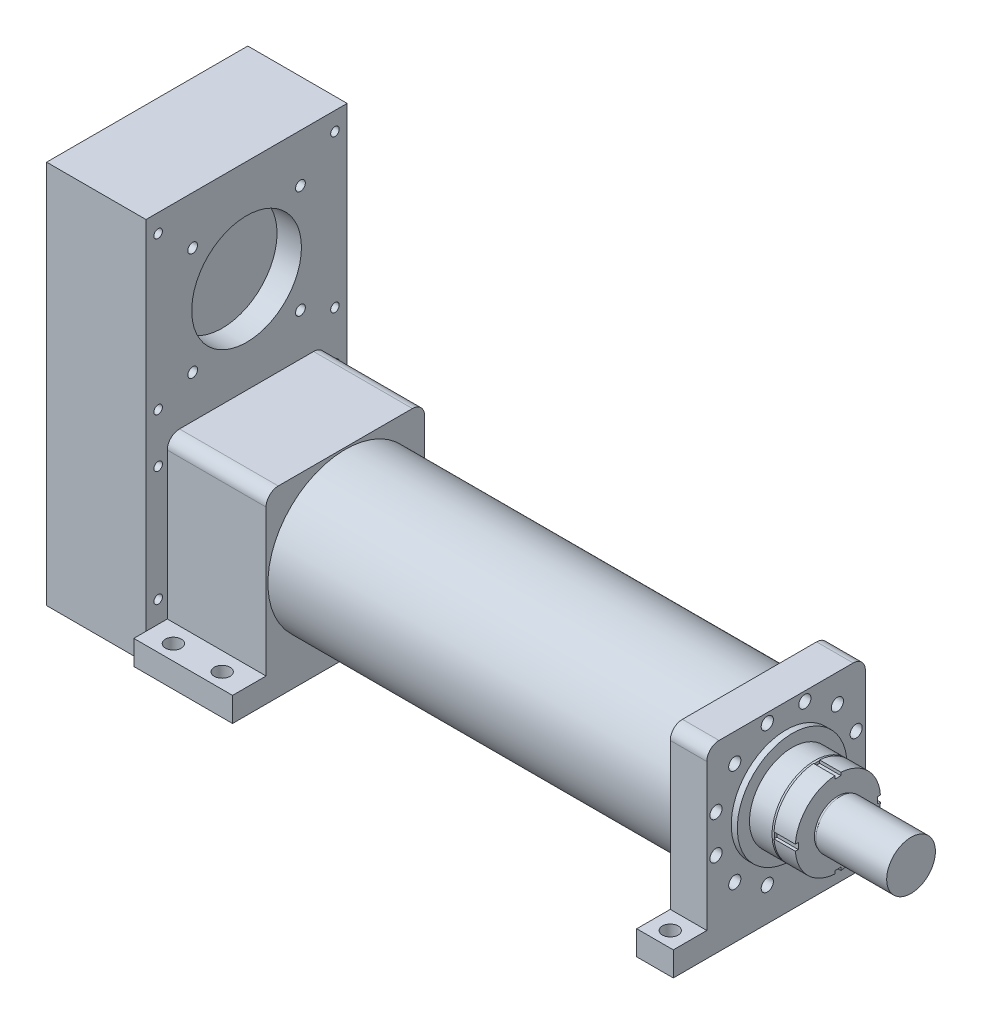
from build123d import *

# Parameters (mm, degrees)
SKETCH_1_R          = 127
SKETCH_1_R_2        = 110
EXTRUDE_1_DEPTH     = 663
EXTRUDE_2_DEPTH     = 60
SKETCH_3_R          = 90
EXTRUDE_3_DEPTH     = 10
SKETCH_5_R          = 70
EXTRUDE_4_DEPTH     = 40
CHAMFER_1_SIZE      = 3
CHAMFER_1_SIZE2     = 1.091910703
SKETCH_7_R          = 70
EXTRUDE_5_DEPTH     = 35
SKETCH_8_R          = 38.5
EXTRUDE_6_DEPTH     = 4
SKETCH_9_R          = 40
EXTRUDE_7_DEPTH     = 116
SKETCH_10_W         = 10
SKETCH_10_H         = 12.219318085
SKETCH_10_W_2       = 33.965202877
SKETCH_10_H_2       = 10
SKETCH_10_H_3       = 35.687535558
CUT_EXTRUDE_2_DEPTH = 35
EXTRUDE_8_DEPTH     = 162
SKETCH_12_W         = 330
SKETCH_12_H         = 630
EXTRUDE_9_DEPTH     = 163
SKETCH_14_R         = 90
SKETCH_14_R_2       = 8
SKETCH_14_R_3       = 7
CUT_EXTRUDE_3_DEPTH = 40
SKETCH_15_R         = 10
SKETCH_15_R_2       = 6.5
CUT_EXTRUDE_4_DEPTH = 20
SKETCH_15_3_R       = 6.5
CUT_EXTRUDE_5_DEPTH = 50
SKETCH_16_W         = 162
SKETCH_16_H         = 370
SKETCH_16_R         = 13
SKETCH_16_W_2       = 60
EXTRUDE_10_DEPTH    = 40


with BuildPart() as part:
    # Sketch 1 → Extrude 1 (new body)
    with BuildSketch(Plane(origin=(0, 0, 0), x_dir=(0, 0, -1), z_dir=(1, 0, 0))):
        Circle(SKETCH_1_R)
        Circle(SKETCH_1_R_2, mode=Mode.SUBTRACT)
    extrude(amount=EXTRUDE_1_DEPTH)


with BuildPart() as body_2:
    # Sketch 2 → Extrude 2 (new body)
    with BuildSketch(Plane(origin=(663, 0, 0), x_dir=(0, 0, -1), z_dir=(1, 0, 0))):
        with BuildLine():
            Line((-130, -110), (-130, -130))
            Line((-130, -130), (-110, -130))
            Line((-110, -130), (110, -130))
            Line((110, -130), (130, -130))
            Line((130, -130), (130, -110))
            Line((130, -110), (130, 110))
            ThreePointArc((130, 110), (124.142135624, 124.142135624), (110, 130))
            Line((110, 130), (-110, 130))
            ThreePointArc((-110, 130), (-124.142135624, 124.142135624), (-130, 110))
            Line((-130, 110), (-130, -110))
        make_face()
    extrude(amount=EXTRUDE_2_DEPTH)

    # Sketch 3 → Extrude 3 (add)
    with BuildSketch(Plane(origin=(723, 0, 0), x_dir=(0, 0, -1), z_dir=(1, 0, 0))):
        Circle(SKETCH_3_R)
    extrude(amount=EXTRUDE_3_DEPTH)

    # Sketch 5 → Extrude 4 (add)
    with BuildSketch(Plane(origin=(733, 0, 0), x_dir=(0, 0, -1), z_dir=(1, 0, 0))):
        Circle(SKETCH_5_R)
    extrude(amount=EXTRUDE_4_DEPTH)

    # Chamfer 1
    chamfer_1_edges = [body_2.edges().sort_by_distance(p)[0] for p in [
        (773, 0, 70),
    ]]
    chamfer_1_side = [body_2.faces().sort_by_distance(p)[0] for p in [
        (753, 0, 70),
    ]]
    chamfer(chamfer_1_edges, length=CHAMFER_1_SIZE, length2=CHAMFER_1_SIZE2, reference=chamfer_1_side[0])

    # Sketch 7 → Extrude 5 (add)
    with BuildSketch(Plane(origin=(773, 0, 0), x_dir=(0, 0, -1), z_dir=(1, 0, 0))):
        Circle(SKETCH_7_R)
    extrude(amount=EXTRUDE_5_DEPTH)

    # Sketch 8 → Extrude 6 (add)
    with BuildSketch(Plane(origin=(808, 0, 0), x_dir=(0, 0, -1), z_dir=(1, 0, 0))):
        Circle(SKETCH_8_R)
    extrude(amount=EXTRUDE_6_DEPTH)

    # Sketch 9 → Extrude 7 (add)
    with BuildSketch(Plane(origin=(812, 0, 0), x_dir=(0, 0, -1), z_dir=(1, 0, 0))):
        with Locations(Location((0, 0, 0), (0, 0, 180))):
            Circle(SKETCH_9_R)
    extrude(amount=EXTRUDE_7_DEPTH)

    # Sketch 10 → Cut-Extrude 2 (cut)
    with BuildSketch(Plane(origin=(808, 0, 0), x_dir=(0, 0, -1), z_dir=(1, 0, 0))):
        with Locations((0, -71.109659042)):
            Rectangle(SKETCH_10_W, SKETCH_10_H)
        Polygon((-76.465931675, 5), (-65, 5), (-65, -5), (-79.460488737, -5), align=None)
        with Locations((81.982601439, 0)):
            Rectangle(SKETCH_10_W_2, SKETCH_10_H_2)
        with Locations((0, 82.843767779)):
            Rectangle(SKETCH_10_W, SKETCH_10_H_3)
    extrude(amount=-CUT_EXTRUDE_2_DEPTH, mode=Mode.SUBTRACT)

    # Sketch 15 → Cut-Extrude 4 (cut)
    # profile 1 of 12: a face of its own
    with BuildSketch(Plane(origin=(723, 0, 0), x_dir=(0, 0, -1), z_dir=(1, 0, 0))):
        with Locations((-84.145706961, 84.145706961)):
            Circle(SKETCH_15_R)
        with Locations((-84.145706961, 84.145706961)):
            Circle(SKETCH_15_R_2, mode=Mode.SUBTRACT)
    # profile 2 of 12: a face of its own
    with BuildSketch(Plane(origin=(723, 0, 0), x_dir=(0, 0, -1), z_dir=(1, 0, 0))):
        with Locations((30.799466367, 114.945173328)):
            Circle(SKETCH_15_R)
    # profile 3 of 12: a face of its own
    with BuildSketch(Plane(origin=(723, 0, 0), x_dir=(0, 0, -1), z_dir=(1, 0, 0))):
        with Locations((84.145706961, 84.145706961)):
            Circle(SKETCH_15_R)
    # profile 4 of 12: a face of its own
    with BuildSketch(Plane(origin=(723, 0, 0), x_dir=(0, 0, -1), z_dir=(1, 0, 0))):
        with Locations((-30.799466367, 114.945173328)):
            Circle(SKETCH_15_R)
    # profile 5 of 12: a face of its own
    with BuildSketch(Plane(origin=(723, 0, 0), x_dir=(0, 0, -1), z_dir=(1, 0, 0))):
        with Locations((-114.945173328, 30.799466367)):
            Circle(SKETCH_15_R)
    # profile 6 of 12: a face of its own
    with BuildSketch(Plane(origin=(723, 0, 0), x_dir=(0, 0, -1), z_dir=(1, 0, 0))):
        with Locations((-114.945173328, -30.799466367)):
            Circle(SKETCH_15_R)
    # profile 7 of 12: a face of its own
    with BuildSketch(Plane(origin=(723, 0, 0), x_dir=(0, 0, -1), z_dir=(1, 0, 0))):
        with Locations((-84.145706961, -84.145706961)):
            Circle(SKETCH_15_R)
    # profile 8 of 12: a face of its own
    with BuildSketch(Plane(origin=(723, 0, 0), x_dir=(0, 0, -1), z_dir=(1, 0, 0))):
        with Locations((-30.799466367, -114.945173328)):
            Circle(SKETCH_15_R)
    # profile 9 of 12: a face of its own
    with BuildSketch(Plane(origin=(723, 0, 0), x_dir=(0, 0, -1), z_dir=(1, 0, 0))):
        with Locations((30.799466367, -114.945173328)):
            Circle(SKETCH_15_R)
    # profile 10 of 12: a face of its own
    with BuildSketch(Plane(origin=(723, 0, 0), x_dir=(0, 0, -1), z_dir=(1, 0, 0))):
        with Locations((84.145706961, -84.145706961)):
            Circle(SKETCH_15_R)
    # profile 11 of 12: a face of its own
    with BuildSketch(Plane(origin=(723, 0, 0), x_dir=(0, 0, -1), z_dir=(1, 0, 0))):
        with Locations((114.945173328, -30.799466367)):
            Circle(SKETCH_15_R)
    # profile 12 of 12: a face of its own
    with BuildSketch(Plane(origin=(723, 0, 0), x_dir=(0, 0, -1), z_dir=(1, 0, 0))):
        with Locations((114.945173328, 30.799466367)):
            Circle(SKETCH_15_R)
    extrude(amount=-CUT_EXTRUDE_4_DEPTH, mode=Mode.SUBTRACT)

    # Sketch 15_3 → Cut-Extrude 5 (cut)
    with BuildSketch(Plane(origin=(723, 0, 0), x_dir=(0, 0, -1), z_dir=(1, 0, 0))):
        with Locations((30.799466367, 114.945173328)):
            Circle(SKETCH_15_3_R)
        with Locations((84.145706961, 84.145706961)):
            Circle(SKETCH_15_3_R)
        with Locations((114.945173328, 30.799466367)):
            Circle(SKETCH_15_3_R)
        with Locations((114.945173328, -30.799466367)):
            Circle(SKETCH_15_3_R)
        with Locations((84.145706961, -84.145706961)):
            Circle(SKETCH_15_3_R)
        with Locations((30.799466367, -114.945173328)):
            Circle(SKETCH_15_3_R)
        with Locations((-30.799466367, -114.945173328)):
            Circle(SKETCH_15_3_R)
        with Locations((-84.145706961, -84.145706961)):
            Circle(SKETCH_15_3_R)
        with Locations((-114.945173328, -30.799466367)):
            Circle(SKETCH_15_3_R)
        with Locations((-114.945173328, 30.799466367)):
            Circle(SKETCH_15_3_R)
        with Locations((-84.145706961, 84.145706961)):
            Circle(SKETCH_15_3_R)
        with Locations((-30.799466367, 114.945173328)):
            Circle(SKETCH_15_3_R)
    extrude(amount=-CUT_EXTRUDE_5_DEPTH, mode=Mode.SUBTRACT)



with BuildPart() as body_3:
    # Sketch 11 → Extrude 8 (new body)
    with BuildSketch(Plane.ZY):
        with BuildLine():
            Line((130, -110), (130, -130))
            Line((130, -130), (110, -130))
            Line((110, -130), (-110, -130))
            Line((-110, -130), (-130, -130))
            Line((-130, -130), (-130, -110))
            Line((-130, -110), (-130, 110))
            ThreePointArc((-130, 110), (-124.142135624, 124.142135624), (-110, 130))
            Line((-110, 130), (110, 130))
            ThreePointArc((110, 130), (124.142135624, 124.142135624), (130, 110))
            Line((130, 110), (130, -110))
        make_face()
    extrude(amount=EXTRUDE_8_DEPTH)


with BuildPart() as body_4:
    # Sketch 12 → Extrude 9 (new body)
    with BuildSketch(Plane.ZY.offset(162)):
        with Locations((0, 140)):
            Rectangle(SKETCH_12_W, SKETCH_12_H)
    extrude(amount=EXTRUDE_9_DEPTH)

    # Sketch 14 → Cut-Extrude 3 (cut)
    with BuildSketch(Plane(origin=(-162, 0, 0), x_dir=(0, 0, -1), z_dir=(1, 0, 0))):
        with Locations((0, 288)):
            Circle(SKETCH_14_R)
        with Locations((-88.388347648, 376.388347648)):
            Circle(SKETCH_14_R_2)
        with Locations((88.388347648, 376.388347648)):
            Circle(SKETCH_14_R_2)
        with Locations((88.388347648, 199.611652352)):
            Circle(SKETCH_14_R_2)
        with Locations((-88.388347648, 199.611652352)):
            Circle(SKETCH_14_R_2)
        with Locations((-145, 175)):
            Circle(SKETCH_14_R_3)
        with Locations((-145, 94.5)):
            Circle(SKETCH_14_R_3)
        with Locations((-145, -94.5)):
            Circle(SKETCH_14_R_3)
        with Locations((-145, -155)):
            Circle(SKETCH_14_R_3)
        with Locations((-145, 425)):
            Circle(SKETCH_14_R_3)
        with Locations(Location((145, -155, 0), (0, 0, 180))):
            Circle(SKETCH_14_R_3)
        with Locations(Location((145, -94.5, 0), (0, 0, 180))):
            Circle(SKETCH_14_R_3)
        with Locations(Location((145, 94.5, 0), (0, 0, 180))):
            Circle(SKETCH_14_R_3)
        with Locations(Location((145, 175, 0), (0, 0, 180))):
            Circle(SKETCH_14_R_3)
        with Locations(Location((145, 425, 0), (0, 0, 180))):
            Circle(SKETCH_14_R_3)
    extrude(amount=-CUT_EXTRUDE_3_DEPTH, mode=Mode.SUBTRACT)


with BuildPart() as body_2_1:
    add(body_2.part)

    add(body_3.part)  # Extrude 10 merges body 3

    add(body_4.part)  # Extrude 10 merges body 4
    # Sketch 16 → Extrude 10 (add)
    # profile 1 of 2: a face of its own
    with BuildSketch(Plane.XZ.offset(130)):
        with Locations((-81, 0)):
            Rectangle(SKETCH_16_W, SKETCH_16_H)
        with Locations(Location((-122, 160, 0), (0, 0, 270))):
            Circle(SKETCH_16_R, mode=Mode.SUBTRACT)
        with Locations(Location((-42, 160, 0), (0, 0, 270))):
            Circle(SKETCH_16_R, mode=Mode.SUBTRACT)
        with Locations(Location((-122, -160, 0), (0, 0, 270))):
            Circle(SKETCH_16_R, mode=Mode.SUBTRACT)
        with Locations(Location((-42, -160, 0), (0, 0, 270))):
            Circle(SKETCH_16_R, mode=Mode.SUBTRACT)
    # profile 2 of 2: a face of its own
    with BuildSketch(Plane.XZ.offset(130)):
        with Locations((693, 0)):
            Rectangle(SKETCH_16_W_2, SKETCH_16_H)
        with Locations(Location((693, 160, 0), (0, 0, 270))):
            Circle(SKETCH_16_R, mode=Mode.SUBTRACT)
        with Locations(Location((693, -160, 0), (0, 0, 270))):
            Circle(SKETCH_16_R, mode=Mode.SUBTRACT)
    extrude(amount=EXTRUDE_10_DEPTH)


solid = Compound([part.part, body_2_1.part])
